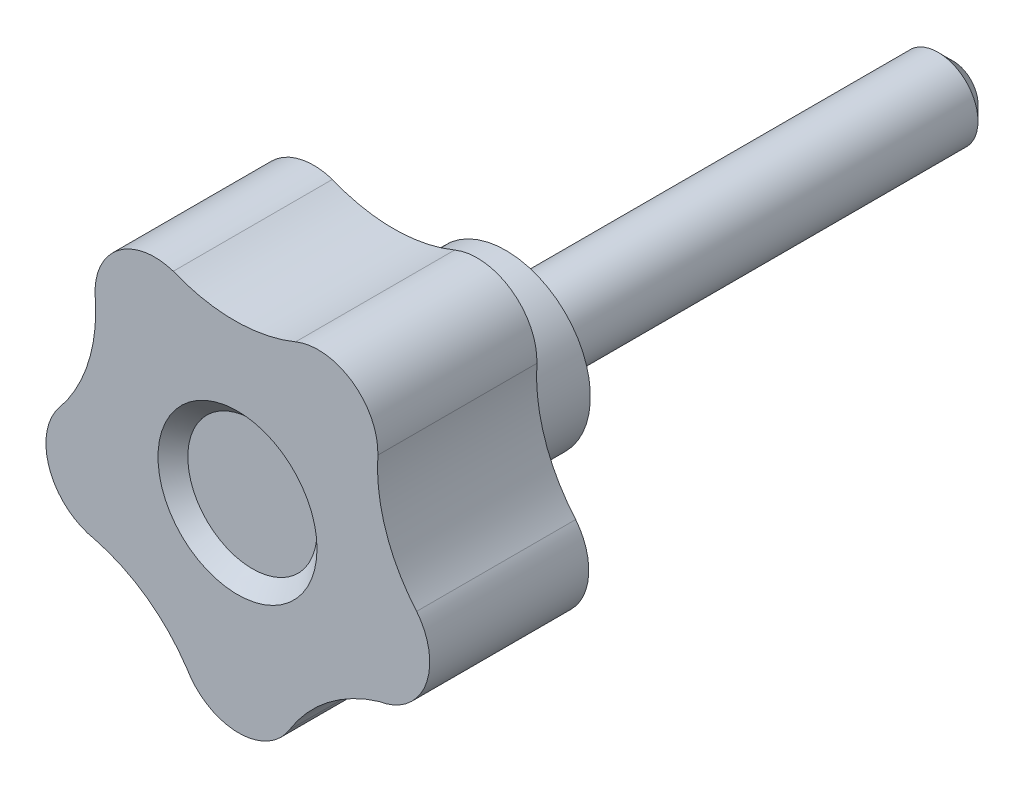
ISO-10303-21;
HEADER;
FILE_DESCRIPTION(('STEP AP214'),'2;1');
FILE_NAME('part.step','',(''),(''),'','','');
FILE_SCHEMA(('AUTOMOTIVE_DESIGN { 1 0 10303 214 1 1 1 1 }'));
ENDSEC;
DATA;
#1=APPLICATION_CONTEXT('core data for automotive mechanical design processes');
#2=APPLICATION_PROTOCOL_DEFINITION('international standard','automotive_design',2000,#1);
#3=PRODUCT_CONTEXT('',#1,'mechanical');
#4=PRODUCT('Part','Part','',(#3));
#5=PRODUCT_RELATED_PRODUCT_CATEGORY('part','',(#4));
#6=PRODUCT_DEFINITION_FORMATION('','',#4);
#7=PRODUCT_DEFINITION_CONTEXT('part definition',#1,'design');
#8=PRODUCT_DEFINITION('design','',#6,#7);
#9=PRODUCT_DEFINITION_SHAPE('','',#8);
#10=(LENGTH_UNIT() NAMED_UNIT(*) SI_UNIT(.MILLI.,.METRE.));
#11=(NAMED_UNIT(*) PLANE_ANGLE_UNIT() SI_UNIT($,.RADIAN.));
#12=(NAMED_UNIT(*) SI_UNIT($,.STERADIAN.) SOLID_ANGLE_UNIT());
#13=UNCERTAINTY_MEASURE_WITH_UNIT(LENGTH_MEASURE(1.E-05),#10,'distance_accuracy_value','');
#14=(GEOMETRIC_REPRESENTATION_CONTEXT(3) GLOBAL_UNCERTAINTY_ASSIGNED_CONTEXT((#13)) GLOBAL_UNIT_ASSIGNED_CONTEXT((#10,
#11,#12)) REPRESENTATION_CONTEXT('',''));
#15=CARTESIAN_POINT('',(0.,0.,0.));
#16=DIRECTION('',(0.,0.,1.));
#17=DIRECTION('',(1.,0.,0.));
#18=AXIS2_PLACEMENT_3D('',#15,#16,#17);
#19=CARTESIAN_POINT('',(0.,0.,-1.5));
#20=DIRECTION('',(0.,0.,-1.));
#21=DIRECTION('',(-1.,0.,0.));
#22=AXIS2_PLACEMENT_3D('',#19,#20,#21);
#23=PLANE('',#22);
#24=CARTESIAN_POINT('',(0.,0.,-1.50000000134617));
#25=DIRECTION('',(0.,0.,1.));
#26=DIRECTION('',(1.,0.,0.));
#27=AXIS2_PLACEMENT_3D('',#24,#25,#26);
#28=CIRCLE('',#27,6.50000000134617);
#29=CARTESIAN_POINT('',(6.50000000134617,0.,-1.50000000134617));
#30=VERTEX_POINT('',#29);
#31=EDGE_CURVE('E18',#30,#30,#28,.T.);
#32=ORIENTED_EDGE('',*,*,#31,.T.);
#33=EDGE_LOOP('',(#32));
#34=FACE_BOUND('',#33,.T.);
#35=ADVANCED_FACE('F15',(#34),#23,.F.);
#36=CARTESIAN_POINT('',(0.,0.,0.));
#37=DIRECTION('',(0.,0.,1.));
#38=DIRECTION('',(1.,0.,0.));
#39=AXIS2_PLACEMENT_3D('',#36,#37,#38);
#40=CONICAL_SURFACE('',#39,8.,0.7853981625);
#41=CARTESIAN_POINT('',(0.,0.,0.));
#42=DIRECTION('',(0.,0.,1.));
#43=DIRECTION('',(1.,0.,0.));
#44=AXIS2_PLACEMENT_3D('',#41,#42,#43);
#45=CIRCLE('',#44,8.);
#46=CARTESIAN_POINT('',(8.,0.,0.));
#47=VERTEX_POINT('',#46);
#48=EDGE_CURVE('E163',#47,#47,#45,.F.);
#49=ORIENTED_EDGE('',*,*,#48,.F.);
#50=EDGE_LOOP('',(#49));
#51=FACE_BOUND('',#50,.T.);
#52=ORIENTED_EDGE('',*,*,#31,.F.);
#53=EDGE_LOOP('',(#52));
#54=FACE_BOUND('',#53,.T.);
#55=ADVANCED_FACE('F328',(#51,#54),#40,.F.);
#56=CARTESIAN_POINT('',(-0.0004142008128,0.004852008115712,0.));
#57=DIRECTION('',(0.,0.,1.));
#58=DIRECTION('',(1.,0.,0.));
#59=AXIS2_PLACEMENT_3D('',#56,#57,#58);
#60=PLANE('',#59);
#61=ORIENTED_EDGE('',*,*,#48,.T.);
#62=EDGE_LOOP('',(#61));
#63=FACE_BOUND('',#62,.T.);
#64=CARTESIAN_POINT('',(-18.4150209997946,-25.8349379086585,0.));
#65=DIRECTION('',(0.,0.,-1.));
#66=DIRECTION('',(-1.,0.,0.));
#67=AXIS2_PLACEMENT_3D('',#64,#65,#66);
#68=CIRCLE('',#67,15.9939018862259);
#69=CARTESIAN_POINT('',(-14.3741936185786,-10.3599060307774,0.));
#70=VERTEX_POINT('',#69);
#71=CARTESIAN_POINT('',(-5.10235955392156,-16.9705178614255,0.));
#72=VERTEX_POINT('',#71);
#73=EDGE_CURVE('E196',#70,#72,#68,.T.);
#74=ORIENTED_EDGE('',*,*,#73,.T.);
#75=CARTESIAN_POINT('',(0.118807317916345,-13.9816803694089,0.));
#76=DIRECTION('',(0.,0.,-1.));
#77=DIRECTION('',(-1.,0.,0.));
#78=AXIS2_PLACEMENT_3D('',#75,#76,#77);
#79=CIRCLE('',#78,6.01612275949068);
#80=CARTESIAN_POINT('',(5.23314372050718,-17.1498495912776,0.));
#81=VERTEX_POINT('',#80);
#82=EDGE_CURVE('E191',#81,#72,#79,.T.);
#83=ORIENTED_EDGE('',*,*,#82,.F.);
#84=CARTESIAN_POINT('',(18.9162231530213,-25.544321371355,0.));
#85=DIRECTION('',(0.,0.,-1.));
#86=DIRECTION('',(-1.,0.,0.));
#87=AXIS2_PLACEMENT_3D('',#84,#85,#86);
#88=CIRCLE('',#87,16.0528445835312);
#89=CARTESIAN_POINT('',(14.2493413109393,-10.1848281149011,0.));
#90=VERTEX_POINT('',#89);
#91=EDGE_CURVE('E169',#81,#90,#88,.T.);
#92=ORIENTED_EDGE('',*,*,#91,.T.);
#93=CARTESIAN_POINT('',(13.2909378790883,-4.21108629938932,0.));
#94=DIRECTION('',(0.,0.,-1.));
#95=DIRECTION('',(-1.,0.,0.));
#96=AXIS2_PLACEMENT_3D('',#93,#94,#95);
#97=CIRCLE('',#96,6.05013457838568);
#98=CARTESIAN_POINT('',(18.023858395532,-0.442321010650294,0.));
#99=VERTEX_POINT('',#98);
#100=EDGE_CURVE('E166',#99,#90,#97,.T.);
#101=ORIENTED_EDGE('',*,*,#100,.F.);
#102=CARTESIAN_POINT('',(30.2805350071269,10.1431988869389,0.));
#103=DIRECTION('',(0.,0.,-1.));
#104=DIRECTION('',(-1.,0.,0.));
#105=AXIS2_PLACEMENT_3D('',#102,#103,#104);
#106=CIRCLE('',#105,16.1950410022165);
#107=CARTESIAN_POINT('',(14.1211155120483,11.216751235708,0.));
#108=VERTEX_POINT('',#107);
#109=EDGE_CURVE('E152',#99,#108,#106,.T.);
#110=ORIENTED_EDGE('',*,*,#109,.T.);
#111=CARTESIAN_POINT('',(8.12377943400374,11.3992354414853,0.));
#112=DIRECTION('',(0.,0.,-1.));
#113=DIRECTION('',(-1.,0.,0.));
#114=AXIS2_PLACEMENT_3D('',#111,#112,#113);
#115=CIRCLE('',#114,6.00011170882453);
#116=CARTESIAN_POINT('',(5.8467261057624,16.9504847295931,0.));
#117=VERTEX_POINT('',#116);
#118=EDGE_CURVE('E162',#117,#108,#115,.T.);
#119=ORIENTED_EDGE('',*,*,#118,.F.);
#120=CARTESIAN_POINT('',(-0.304345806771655,31.8234206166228,0.));
#121=DIRECTION('',(0.,0.,-1.));
#122=DIRECTION('',(-1.,0.,0.));
#123=AXIS2_PLACEMENT_3D('',#120,#121,#122);
#124=CIRCLE('',#123,16.0947167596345);
#125=CARTESIAN_POINT('',(-6.45541771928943,16.9504847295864,0.));
#126=VERTEX_POINT('',#125);
#127=EDGE_CURVE('E213',#117,#126,#124,.T.);
#128=ORIENTED_EDGE('',*,*,#127,.T.);
#129=CARTESIAN_POINT('',(-8.3283267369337,11.2475346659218,0.));
#130=DIRECTION('',(0.,0.,-1.));
#131=DIRECTION('',(-1.,0.,0.));
#132=AXIS2_PLACEMENT_3D('',#129,#130,#131);
#133=CIRCLE('',#132,6.00261839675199);
#134=CARTESIAN_POINT('',(-14.3141303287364,10.7985547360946,0.));
#135=VERTEX_POINT('',#134);
#136=EDGE_CURVE('E208',#135,#126,#133,.T.);
#137=ORIENTED_EDGE('',*,*,#136,.F.);
#138=CARTESIAN_POINT('',(-30.3288462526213,9.55164569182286,0.));
#139=DIRECTION('',(0.,0.,-1.));
#140=DIRECTION('',(-1.,0.,0.));
#141=AXIS2_PLACEMENT_3D('',#138,#139,#140);
#142=CIRCLE('',#141,16.0631848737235);
#143=CARTESIAN_POINT('',(-17.9188230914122,-0.647238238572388,0.));
#144=VERTEX_POINT('',#143);
#145=EDGE_CURVE('E204',#135,#144,#142,.T.);
#146=ORIENTED_EDGE('',*,*,#145,.T.);
#147=CARTESIAN_POINT('',(-13.258877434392,-4.44973379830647,0.));
#148=DIRECTION('',(0.,0.,-1.));
#149=DIRECTION('',(-1.,0.,0.));
#150=AXIS2_PLACEMENT_3D('',#147,#148,#149);
#151=CIRCLE('',#150,6.01448800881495);
#152=EDGE_CURVE('E200',#70,#144,#151,.T.);
#153=ORIENTED_EDGE('',*,*,#152,.F.);
#154=EDGE_LOOP('',(#74,#83,#92,#101,#110,#119,#128,#137,#146,#153));
#155=FACE_BOUND('',#154,.T.);
#156=ADVANCED_FACE('F167',(#63,#155),#60,.T.);
#157=CARTESIAN_POINT('',(30.2805350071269,10.1431988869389,0.));
#158=DIRECTION('',(0.,0.,-1.));
#159=DIRECTION('',(-1.,0.,0.));
#160=AXIS2_PLACEMENT_3D('',#157,#158,#159);
#161=CYLINDRICAL_SURFACE('',#160,16.1950410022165);
#162=DIRECTION('',(0.,0.,-1.));
#163=VECTOR('',#162,1.);
#164=CARTESIAN_POINT('',(14.1211155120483,11.2167512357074,0.));
#165=LINE('',#164,#163);
#166=CARTESIAN_POINT('',(14.1211155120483,11.216751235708,-16.));
#167=VERTEX_POINT('',#166);
#168=EDGE_CURVE('E159',#108,#167,#165,.T.);
#169=ORIENTED_EDGE('',*,*,#168,.F.);
#170=ORIENTED_EDGE('',*,*,#109,.F.);
#171=DIRECTION('',(0.,0.,-1.));
#172=VECTOR('',#171,1.);
#173=CARTESIAN_POINT('',(18.0238583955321,-0.442321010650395,0.));
#174=LINE('',#173,#172);
#175=CARTESIAN_POINT('',(18.0238583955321,-0.442321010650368,-16.));
#176=VERTEX_POINT('',#175);
#177=EDGE_CURVE('E156',#176,#99,#174,.F.);
#178=ORIENTED_EDGE('',*,*,#177,.F.);
#179=CARTESIAN_POINT('',(30.2805350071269,10.1431988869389,-16.));
#180=DIRECTION('',(0.,0.,-1.));
#181=DIRECTION('',(-1.,0.,0.));
#182=AXIS2_PLACEMENT_3D('',#179,#180,#181);
#183=CIRCLE('',#182,16.1950410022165);
#184=EDGE_CURVE('E310',#176,#167,#183,.T.);
#185=ORIENTED_EDGE('',*,*,#184,.T.);
#186=EDGE_LOOP('',(#169,#170,#178,#185));
#187=FACE_BOUND('',#186,.T.);
#188=ADVANCED_FACE('F154',(#187),#161,.F.);
#189=CARTESIAN_POINT('',(8.12377943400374,11.3992354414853,0.));
#190=DIRECTION('',(0.,0.,-1.));
#191=DIRECTION('',(-1.,0.,0.));
#192=AXIS2_PLACEMENT_3D('',#189,#190,#191);
#193=CYLINDRICAL_SURFACE('',#192,6.00011170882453);
#194=ORIENTED_EDGE('',*,*,#118,.T.);
#195=ORIENTED_EDGE('',*,*,#168,.T.);
#196=CARTESIAN_POINT('',(8.12377943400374,11.3992354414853,-16.));
#197=DIRECTION('',(0.,0.,-1.));
#198=DIRECTION('',(-1.,0.,0.));
#199=AXIS2_PLACEMENT_3D('',#196,#197,#198);
#200=CIRCLE('',#199,6.00011170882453);
#201=CARTESIAN_POINT('',(5.8467261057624,16.9504847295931,-16.));
#202=VERTEX_POINT('',#201);
#203=EDGE_CURVE('E308',#167,#202,#200,.F.);
#204=ORIENTED_EDGE('',*,*,#203,.T.);
#205=DIRECTION('',(0.,0.,-1.));
#206=VECTOR('',#205,1.);
#207=CARTESIAN_POINT('',(5.84672610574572,16.9504847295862,0.));
#208=LINE('',#207,#206);
#209=EDGE_CURVE('E209',#202,#117,#208,.F.);
#210=ORIENTED_EDGE('',*,*,#209,.T.);
#211=EDGE_LOOP('',(#194,#195,#204,#210));
#212=FACE_BOUND('',#211,.T.);
#213=ADVANCED_FACE('F447',(#212),#193,.T.);
#214=CARTESIAN_POINT('',(-0.304345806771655,31.8234206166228,0.));
#215=DIRECTION('',(0.,0.,-1.));
#216=DIRECTION('',(-1.,0.,0.));
#217=AXIS2_PLACEMENT_3D('',#214,#215,#216);
#218=CYLINDRICAL_SURFACE('',#217,16.0947167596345);
#219=DIRECTION('',(0.,0.,-1.));
#220=VECTOR('',#219,1.);
#221=CARTESIAN_POINT('',(-6.45541771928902,16.9504847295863,0.));
#222=LINE('',#221,#220);
#223=CARTESIAN_POINT('',(-6.45541771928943,16.9504847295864,-16.));
#224=VERTEX_POINT('',#223);
#225=EDGE_CURVE('E205',#126,#224,#222,.T.);
#226=ORIENTED_EDGE('',*,*,#225,.F.);
#227=ORIENTED_EDGE('',*,*,#127,.F.);
#228=ORIENTED_EDGE('',*,*,#209,.F.);
#229=CARTESIAN_POINT('',(-0.304345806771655,31.8234206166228,-16.));
#230=DIRECTION('',(0.,0.,-1.));
#231=DIRECTION('',(-1.,0.,0.));
#232=AXIS2_PLACEMENT_3D('',#229,#230,#231);
#233=CIRCLE('',#232,16.0947167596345);
#234=EDGE_CURVE('E306',#202,#224,#233,.T.);
#235=ORIENTED_EDGE('',*,*,#234,.T.);
#236=EDGE_LOOP('',(#226,#227,#228,#235));
#237=FACE_BOUND('',#236,.T.);
#238=ADVANCED_FACE('F443',(#237),#218,.F.);
#239=CARTESIAN_POINT('',(-8.3283267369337,11.2475346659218,0.));
#240=DIRECTION('',(0.,0.,-1.));
#241=DIRECTION('',(-1.,0.,0.));
#242=AXIS2_PLACEMENT_3D('',#239,#240,#241);
#243=CYLINDRICAL_SURFACE('',#242,6.00261839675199);
#244=ORIENTED_EDGE('',*,*,#136,.T.);
#245=ORIENTED_EDGE('',*,*,#225,.T.);
#246=CARTESIAN_POINT('',(-8.3283267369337,11.2475346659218,-16.));
#247=DIRECTION('',(0.,0.,-1.));
#248=DIRECTION('',(-1.,0.,0.));
#249=AXIS2_PLACEMENT_3D('',#246,#247,#248);
#250=CIRCLE('',#249,6.00261839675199);
#251=CARTESIAN_POINT('',(-14.3141303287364,10.7985547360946,-16.));
#252=VERTEX_POINT('',#251);
#253=EDGE_CURVE('E304',#224,#252,#250,.F.);
#254=ORIENTED_EDGE('',*,*,#253,.T.);
#255=DIRECTION('',(0.,0.,-1.));
#256=VECTOR('',#255,1.);
#257=CARTESIAN_POINT('',(-14.3141303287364,10.7985547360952,0.));
#258=LINE('',#257,#256);
#259=EDGE_CURVE('E201',#252,#135,#258,.F.);
#260=ORIENTED_EDGE('',*,*,#259,.T.);
#261=EDGE_LOOP('',(#244,#245,#254,#260));
#262=FACE_BOUND('',#261,.T.);
#263=ADVANCED_FACE('F439',(#262),#243,.T.);
#264=CARTESIAN_POINT('',(-30.3288462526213,9.55164569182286,0.));
#265=DIRECTION('',(0.,0.,-1.));
#266=DIRECTION('',(-1.,0.,0.));
#267=AXIS2_PLACEMENT_3D('',#264,#265,#266);
#268=CYLINDRICAL_SURFACE('',#267,16.0631848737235);
#269=DIRECTION('',(0.,0.,-1.));
#270=VECTOR('',#269,1.);
#271=CARTESIAN_POINT('',(-17.9188230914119,-0.647238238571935,0.));
#272=LINE('',#271,#270);
#273=CARTESIAN_POINT('',(-17.9188230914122,-0.647238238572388,-16.));
#274=VERTEX_POINT('',#273);
#275=EDGE_CURVE('E197',#144,#274,#272,.T.);
#276=ORIENTED_EDGE('',*,*,#275,.F.);
#277=ORIENTED_EDGE('',*,*,#145,.F.);
#278=ORIENTED_EDGE('',*,*,#259,.F.);
#279=CARTESIAN_POINT('',(-30.3288462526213,9.55164569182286,-16.));
#280=DIRECTION('',(0.,0.,-1.));
#281=DIRECTION('',(-1.,0.,0.));
#282=AXIS2_PLACEMENT_3D('',#279,#280,#281);
#283=CIRCLE('',#282,16.0631848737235);
#284=EDGE_CURVE('E302',#252,#274,#283,.T.);
#285=ORIENTED_EDGE('',*,*,#284,.T.);
#286=EDGE_LOOP('',(#276,#277,#278,#285));
#287=FACE_BOUND('',#286,.T.);
#288=ADVANCED_FACE('F435',(#287),#268,.F.);
#289=CARTESIAN_POINT('',(-13.258877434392,-4.44973379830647,0.));
#290=DIRECTION('',(0.,0.,-1.));
#291=DIRECTION('',(-1.,0.,0.));
#292=AXIS2_PLACEMENT_3D('',#289,#290,#291);
#293=CYLINDRICAL_SURFACE('',#292,6.01448800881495);
#294=ORIENTED_EDGE('',*,*,#152,.T.);
#295=ORIENTED_EDGE('',*,*,#275,.T.);
#296=CARTESIAN_POINT('',(-13.258877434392,-4.44973379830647,-16.));
#297=DIRECTION('',(0.,0.,-1.));
#298=DIRECTION('',(-1.,0.,0.));
#299=AXIS2_PLACEMENT_3D('',#296,#297,#298);
#300=CIRCLE('',#299,6.01448800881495);
#301=CARTESIAN_POINT('',(-14.3741936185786,-10.3599060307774,-16.));
#302=VERTEX_POINT('',#301);
#303=EDGE_CURVE('E300',#274,#302,#300,.F.);
#304=ORIENTED_EDGE('',*,*,#303,.T.);
#305=DIRECTION('',(0.,0.,-1.));
#306=VECTOR('',#305,1.);
#307=CARTESIAN_POINT('',(-14.3741936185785,-10.3599060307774,0.));
#308=LINE('',#307,#306);
#309=EDGE_CURVE('E192',#302,#70,#308,.F.);
#310=ORIENTED_EDGE('',*,*,#309,.T.);
#311=EDGE_LOOP('',(#294,#295,#304,#310));
#312=FACE_BOUND('',#311,.T.);
#313=ADVANCED_FACE('F431',(#312),#293,.T.);
#314=CARTESIAN_POINT('',(-18.4150209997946,-25.8349379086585,0.));
#315=DIRECTION('',(0.,0.,-1.));
#316=DIRECTION('',(-1.,0.,0.));
#317=AXIS2_PLACEMENT_3D('',#314,#315,#316);
#318=CYLINDRICAL_SURFACE('',#317,15.9939018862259);
#319=DIRECTION('',(0.,0.,-1.));
#320=VECTOR('',#319,1.);
#321=CARTESIAN_POINT('',(-5.10235955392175,-16.9705178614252,0.));
#322=LINE('',#321,#320);
#323=CARTESIAN_POINT('',(-5.10235955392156,-16.9705178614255,-16.));
#324=VERTEX_POINT('',#323);
#325=EDGE_CURVE('E187',#72,#324,#322,.T.);
#326=ORIENTED_EDGE('',*,*,#325,.F.);
#327=ORIENTED_EDGE('',*,*,#73,.F.);
#328=ORIENTED_EDGE('',*,*,#309,.F.);
#329=CARTESIAN_POINT('',(-18.4150209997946,-25.8349379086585,-16.));
#330=DIRECTION('',(0.,0.,-1.));
#331=DIRECTION('',(-1.,0.,0.));
#332=AXIS2_PLACEMENT_3D('',#329,#330,#331);
#333=CIRCLE('',#332,15.9939018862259);
#334=EDGE_CURVE('E298',#302,#324,#333,.T.);
#335=ORIENTED_EDGE('',*,*,#334,.T.);
#336=EDGE_LOOP('',(#326,#327,#328,#335));
#337=FACE_BOUND('',#336,.T.);
#338=ADVANCED_FACE('F427',(#337),#318,.F.);
#339=CARTESIAN_POINT('',(0.118807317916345,-13.9816803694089,0.));
#340=DIRECTION('',(0.,0.,-1.));
#341=DIRECTION('',(-1.,0.,0.));
#342=AXIS2_PLACEMENT_3D('',#339,#340,#341);
#343=CYLINDRICAL_SURFACE('',#342,6.01612275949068);
#344=ORIENTED_EDGE('',*,*,#82,.T.);
#345=ORIENTED_EDGE('',*,*,#325,.T.);
#346=CARTESIAN_POINT('',(0.118807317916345,-13.9816803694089,-16.));
#347=DIRECTION('',(0.,0.,-1.));
#348=DIRECTION('',(-1.,0.,0.));
#349=AXIS2_PLACEMENT_3D('',#346,#347,#348);
#350=CIRCLE('',#349,6.01612275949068);
#351=CARTESIAN_POINT('',(5.23314372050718,-17.1498495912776,-16.));
#352=VERTEX_POINT('',#351);
#353=EDGE_CURVE('E296',#324,#352,#350,.F.);
#354=ORIENTED_EDGE('',*,*,#353,.T.);
#355=DIRECTION('',(0.,0.,-1.));
#356=VECTOR('',#355,1.);
#357=CARTESIAN_POINT('',(5.23314372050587,-17.1498495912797,0.));
#358=LINE('',#357,#356);
#359=EDGE_CURVE('E180',#352,#81,#358,.F.);
#360=ORIENTED_EDGE('',*,*,#359,.T.);
#361=EDGE_LOOP('',(#344,#345,#354,#360));
#362=FACE_BOUND('',#361,.T.);
#363=ADVANCED_FACE('F423',(#362),#343,.T.);
#364=CARTESIAN_POINT('',(18.9162231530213,-25.544321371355,0.));
#365=DIRECTION('',(0.,0.,-1.));
#366=DIRECTION('',(-1.,0.,0.));
#367=AXIS2_PLACEMENT_3D('',#364,#365,#366);
#368=CYLINDRICAL_SURFACE('',#367,16.0528445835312);
#369=DIRECTION('',(0.,0.,-1.));
#370=VECTOR('',#369,1.);
#371=CARTESIAN_POINT('',(14.2493413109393,-10.1848281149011,0.));
#372=LINE('',#371,#370);
#373=CARTESIAN_POINT('',(14.2493413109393,-10.1848281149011,-16.));
#374=VERTEX_POINT('',#373);
#375=EDGE_CURVE('E173',#90,#374,#372,.T.);
#376=ORIENTED_EDGE('',*,*,#375,.F.);
#377=ORIENTED_EDGE('',*,*,#91,.F.);
#378=ORIENTED_EDGE('',*,*,#359,.F.);
#379=CARTESIAN_POINT('',(18.9162231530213,-25.544321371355,-16.));
#380=DIRECTION('',(0.,0.,-1.));
#381=DIRECTION('',(-1.,0.,0.));
#382=AXIS2_PLACEMENT_3D('',#379,#380,#381);
#383=CIRCLE('',#382,16.0528445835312);
#384=EDGE_CURVE('E294',#352,#374,#383,.T.);
#385=ORIENTED_EDGE('',*,*,#384,.T.);
#386=EDGE_LOOP('',(#376,#377,#378,#385));
#387=FACE_BOUND('',#386,.T.);
#388=ADVANCED_FACE('F420',(#387),#368,.F.);
#389=CARTESIAN_POINT('',(13.2909378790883,-4.21108629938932,0.));
#390=DIRECTION('',(0.,0.,-1.));
#391=DIRECTION('',(-1.,0.,0.));
#392=AXIS2_PLACEMENT_3D('',#389,#390,#391);
#393=CYLINDRICAL_SURFACE('',#392,6.05013457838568);
#394=ORIENTED_EDGE('',*,*,#100,.T.);
#395=ORIENTED_EDGE('',*,*,#375,.T.);
#396=CARTESIAN_POINT('',(13.2909378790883,-4.21108629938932,-16.));
#397=DIRECTION('',(0.,0.,-1.));
#398=DIRECTION('',(-1.,0.,0.));
#399=AXIS2_PLACEMENT_3D('',#396,#397,#398);
#400=CIRCLE('',#399,6.05013457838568);
#401=EDGE_CURVE('E177',#374,#176,#400,.F.);
#402=ORIENTED_EDGE('',*,*,#401,.T.);
#403=ORIENTED_EDGE('',*,*,#177,.T.);
#404=EDGE_LOOP('',(#394,#395,#402,#403));
#405=FACE_BOUND('',#404,.T.);
#406=ADVANCED_FACE('F175',(#405),#393,.T.);
#407=CARTESIAN_POINT('',(-0.0004142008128,0.004852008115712,-16.));
#408=DIRECTION('',(0.,0.,1.));
#409=DIRECTION('',(1.,0.,0.));
#410=AXIS2_PLACEMENT_3D('',#407,#408,#409);
#411=PLANE('',#410);
#412=CARTESIAN_POINT('',(30.2805350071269,10.1431988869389,-16.));
#413=DIRECTION('',(0.,0.,-1.));
#414=DIRECTION('',(-1.,0.,0.));
#415=AXIS2_PLACEMENT_3D('',#412,#413,#414);
#416=CIRCLE('',#415,19.6950410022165);
#417=CARTESIAN_POINT('',(10.6237156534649,11.3696135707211,-16.));
#418=VERTEX_POINT('',#417);
#419=CARTESIAN_POINT('',(15.3176912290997,-2.66335982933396,-16.));
#420=VERTEX_POINT('',#419);
#421=EDGE_CURVE('E287',#418,#420,#416,.F.);
#422=ORIENTED_EDGE('',*,*,#421,.F.);
#423=CARTESIAN_POINT('',(8.12377943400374,11.3992354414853,-16.));
#424=DIRECTION('',(0.,0.,-1.));
#425=DIRECTION('',(-1.,0.,0.));
#426=AXIS2_PLACEMENT_3D('',#423,#424,#425);
#427=CIRCLE('',#426,2.50011170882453);
#428=CARTESIAN_POINT('',(7.17844479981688,13.71373344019,-16.));
#429=VERTEX_POINT('',#428);
#430=EDGE_CURVE('E284',#418,#429,#427,.F.);
#431=ORIENTED_EDGE('',*,*,#430,.T.);
#432=CARTESIAN_POINT('',(-0.304345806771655,31.8234206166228,-16.));
#433=DIRECTION('',(0.,0.,-1.));
#434=DIRECTION('',(-1.,0.,0.));
#435=AXIS2_PLACEMENT_3D('',#432,#433,#434);
#436=CIRCLE('',#435,19.5947167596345);
#437=CARTESIAN_POINT('',(-7.6399742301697,13.6536247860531,-16.));
#438=VERTEX_POINT('',#437);
#439=EDGE_CURVE('E280',#438,#429,#436,.F.);
#440=ORIENTED_EDGE('',*,*,#439,.F.);
#441=CARTESIAN_POINT('',(-8.3283267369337,11.2475346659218,-16.));
#442=DIRECTION('',(0.,0.,-1.));
#443=DIRECTION('',(-1.,0.,0.));
#444=AXIS2_PLACEMENT_3D('',#441,#442,#443);
#445=CIRCLE('',#444,2.50261839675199);
#446=CARTESIAN_POINT('',(-10.8242060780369,11.0639995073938,-16.));
#447=VERTEX_POINT('',#446);
#448=EDGE_CURVE('E277',#438,#447,#445,.F.);
#449=ORIENTED_EDGE('',*,*,#448,.T.);
#450=CARTESIAN_POINT('',(-30.3288462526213,9.55164569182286,-16.));
#451=DIRECTION('',(0.,0.,-1.));
#452=DIRECTION('',(-1.,0.,0.));
#453=AXIS2_PLACEMENT_3D('',#450,#451,#452);
#454=CIRCLE('',#453,19.5631848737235);
#455=CARTESIAN_POINT('',(-15.2099194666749,-2.86351662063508,-16.));
#456=VERTEX_POINT('',#455);
#457=EDGE_CURVE('E273',#456,#447,#454,.F.);
#458=ORIENTED_EDGE('',*,*,#457,.F.);
#459=CARTESIAN_POINT('',(-13.258877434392,-4.44973379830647,-16.));
#460=DIRECTION('',(0.,0.,-1.));
#461=DIRECTION('',(-1.,0.,0.));
#462=AXIS2_PLACEMENT_3D('',#459,#460,#461);
#463=CIRCLE('',#462,2.51448800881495);
#464=CARTESIAN_POINT('',(-13.6373059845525,-6.93558209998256,-16.));
#465=VERTEX_POINT('',#464);
#466=EDGE_CURVE('E270',#456,#465,#463,.F.);
#467=ORIENTED_EDGE('',*,*,#466,.T.);
#468=CARTESIAN_POINT('',(-18.4150209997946,-25.8349379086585,-16.));
#469=DIRECTION('',(0.,0.,-1.));
#470=DIRECTION('',(-1.,0.,0.));
#471=AXIS2_PLACEMENT_3D('',#468,#469,#470);
#472=CIRCLE('',#471,19.4939018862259);
#473=CARTESIAN_POINT('',(-2.10692086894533,-15.1551401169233,-16.));
#474=VERTEX_POINT('',#473);
#475=EDGE_CURVE('E266',#474,#465,#472,.F.);
#476=ORIENTED_EDGE('',*,*,#475,.F.);
#477=CARTESIAN_POINT('',(0.118807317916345,-13.9816803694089,-16.));
#478=DIRECTION('',(0.,0.,-1.));
#479=DIRECTION('',(-1.,0.,0.));
#480=AXIS2_PLACEMENT_3D('',#477,#478,#479);
#481=CIRCLE('',#480,2.51612275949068);
#482=CARTESIAN_POINT('',(2.25482210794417,-15.311460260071,-16.));
#483=VERTEX_POINT('',#482);
#484=EDGE_CURVE('E263',#474,#483,#481,.F.);
#485=ORIENTED_EDGE('',*,*,#484,.T.);
#486=CARTESIAN_POINT('',(18.9162231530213,-25.544321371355,-16.));
#487=DIRECTION('',(0.,0.,-1.));
#488=DIRECTION('',(-1.,0.,0.));
#489=AXIS2_PLACEMENT_3D('',#486,#487,#488);
#490=CIRCLE('',#489,19.5528445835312);
#491=CARTESIAN_POINT('',(13.5196909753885,-6.75094030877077,-16.));
#492=VERTEX_POINT('',#491);
#493=EDGE_CURVE('E259',#492,#483,#490,.F.);
#494=ORIENTED_EDGE('',*,*,#493,.F.);
#495=CARTESIAN_POINT('',(13.2909378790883,-4.21108629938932,-16.));
#496=DIRECTION('',(0.,0.,-1.));
#497=DIRECTION('',(-1.,0.,0.));
#498=AXIS2_PLACEMENT_3D('',#495,#496,#497);
#499=CIRCLE('',#498,2.55013457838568);
#500=EDGE_CURVE('E291',#492,#420,#499,.F.);
#501=ORIENTED_EDGE('',*,*,#500,.T.);
#502=EDGE_LOOP('',(#422,#431,#440,#449,#458,#467,#476,#485,#494,#501));
#503=FACE_BOUND('',#502,.T.);
#504=ORIENTED_EDGE('',*,*,#384,.F.);
#505=ORIENTED_EDGE('',*,*,#353,.F.);
#506=ORIENTED_EDGE('',*,*,#334,.F.);
#507=ORIENTED_EDGE('',*,*,#303,.F.);
#508=ORIENTED_EDGE('',*,*,#284,.F.);
#509=ORIENTED_EDGE('',*,*,#253,.F.);
#510=ORIENTED_EDGE('',*,*,#234,.F.);
#511=ORIENTED_EDGE('',*,*,#203,.F.);
#512=ORIENTED_EDGE('',*,*,#184,.F.);
#513=ORIENTED_EDGE('',*,*,#401,.F.);
#514=EDGE_LOOP('',(#504,#505,#506,#507,#508,#509,#510,#511,#512,#513));
#515=FACE_BOUND('',#514,.T.);
#516=ADVANCED_FACE('F413',(#503,#515),#411,.F.);
#517=CARTESIAN_POINT('',(13.2909378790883,-4.21108629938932,0.));
#518=DIRECTION('',(0.,0.,-1.));
#519=DIRECTION('',(-1.,0.,0.));
#520=AXIS2_PLACEMENT_3D('',#517,#518,#519);
#521=CYLINDRICAL_SURFACE('',#520,2.55013457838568);
#522=DIRECTION('',(0.,0.,-1.));
#523=VECTOR('',#522,1.);
#524=CARTESIAN_POINT('',(13.519690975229,-6.75094030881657,0.));
#525=LINE('',#524,#523);
#526=CARTESIAN_POINT('',(13.5196909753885,-6.75094030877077,-3.5));
#527=VERTEX_POINT('',#526);
#528=EDGE_CURVE('E258',#527,#492,#525,.T.);
#529=ORIENTED_EDGE('',*,*,#528,.F.);
#530=CARTESIAN_POINT('',(13.2909378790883,-4.21108629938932,-3.5));
#531=DIRECTION('',(0.,0.,-1.));
#532=DIRECTION('',(-1.,0.,0.));
#533=AXIS2_PLACEMENT_3D('',#530,#531,#532);
#534=CIRCLE('',#533,2.55013457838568);
#535=CARTESIAN_POINT('',(15.3176912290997,-2.66335982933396,-3.5));
#536=VERTEX_POINT('',#535);
#537=EDGE_CURVE('E256',#527,#536,#534,.F.);
#538=ORIENTED_EDGE('',*,*,#537,.T.);
#539=DIRECTION('',(0.,0.,-1.));
#540=VECTOR('',#539,1.);
#541=CARTESIAN_POINT('',(15.3176912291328,-2.66335982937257,0.));
#542=LINE('',#541,#540);
#543=EDGE_CURVE('E290',#420,#536,#542,.F.);
#544=ORIENTED_EDGE('',*,*,#543,.F.);
#545=ORIENTED_EDGE('',*,*,#500,.F.);
#546=EDGE_LOOP('',(#529,#538,#544,#545));
#547=FACE_BOUND('',#546,.T.);
#548=ADVANCED_FACE('F409',(#547),#521,.F.);
#549=CARTESIAN_POINT('',(30.2805350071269,10.1431988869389,0.));
#550=DIRECTION('',(0.,0.,-1.));
#551=DIRECTION('',(-1.,0.,0.));
#552=AXIS2_PLACEMENT_3D('',#549,#550,#551);
#553=CYLINDRICAL_SURFACE('',#552,19.6950410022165);
#554=CARTESIAN_POINT('',(30.2805350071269,10.1431988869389,-3.5));
#555=DIRECTION('',(0.,0.,-1.));
#556=DIRECTION('',(-1.,0.,0.));
#557=AXIS2_PLACEMENT_3D('',#554,#555,#556);
#558=CIRCLE('',#557,19.6950410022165);
#559=CARTESIAN_POINT('',(10.6237156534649,11.3696135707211,-3.5));
#560=VERTEX_POINT('',#559);
#561=EDGE_CURVE('E253',#536,#560,#558,.T.);
#562=ORIENTED_EDGE('',*,*,#561,.T.);
#563=DIRECTION('',(0.,0.,-1.));
#564=VECTOR('',#563,1.);
#565=CARTESIAN_POINT('',(10.6237156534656,11.3696135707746,0.));
#566=LINE('',#565,#564);
#567=EDGE_CURVE('E286',#560,#418,#566,.T.);
#568=ORIENTED_EDGE('',*,*,#567,.T.);
#569=ORIENTED_EDGE('',*,*,#421,.T.);
#570=ORIENTED_EDGE('',*,*,#543,.T.);
#571=EDGE_LOOP('',(#562,#568,#569,#570));
#572=FACE_BOUND('',#571,.T.);
#573=ADVANCED_FACE('F405',(#572),#553,.T.);
#574=CARTESIAN_POINT('',(8.12377943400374,11.3992354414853,0.));
#575=DIRECTION('',(0.,0.,-1.));
#576=DIRECTION('',(-1.,0.,0.));
#577=AXIS2_PLACEMENT_3D('',#574,#575,#576);
#578=CYLINDRICAL_SURFACE('',#577,2.50011170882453);
#579=ORIENTED_EDGE('',*,*,#567,.F.);
#580=CARTESIAN_POINT('',(8.12377943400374,11.3992354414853,-3.5));
#581=DIRECTION('',(0.,0.,-1.));
#582=DIRECTION('',(-1.,0.,0.));
#583=AXIS2_PLACEMENT_3D('',#580,#581,#582);
#584=CIRCLE('',#583,2.50011170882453);
#585=CARTESIAN_POINT('',(7.17844479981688,13.71373344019,-3.5));
#586=VERTEX_POINT('',#585);
#587=EDGE_CURVE('E250',#560,#586,#584,.F.);
#588=ORIENTED_EDGE('',*,*,#587,.T.);
#589=DIRECTION('',(0.,0.,-1.));
#590=VECTOR('',#589,1.);
#591=CARTESIAN_POINT('',(7.17844479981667,13.71373344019,0.));
#592=LINE('',#591,#590);
#593=EDGE_CURVE('E283',#429,#586,#592,.F.);
#594=ORIENTED_EDGE('',*,*,#593,.F.);
#595=ORIENTED_EDGE('',*,*,#430,.F.);
#596=EDGE_LOOP('',(#579,#588,#594,#595));
#597=FACE_BOUND('',#596,.T.);
#598=ADVANCED_FACE('F401',(#597),#578,.F.);
#599=CARTESIAN_POINT('',(-0.304345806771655,31.8234206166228,0.));
#600=DIRECTION('',(0.,0.,-1.));
#601=DIRECTION('',(-1.,0.,0.));
#602=AXIS2_PLACEMENT_3D('',#599,#600,#601);
#603=CYLINDRICAL_SURFACE('',#602,19.5947167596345);
#604=CARTESIAN_POINT('',(-0.304345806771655,31.8234206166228,-3.5));
#605=DIRECTION('',(0.,0.,-1.));
#606=DIRECTION('',(-1.,0.,0.));
#607=AXIS2_PLACEMENT_3D('',#604,#605,#606);
#608=CIRCLE('',#607,19.5947167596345);
#609=CARTESIAN_POINT('',(-7.6399742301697,13.6536247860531,-3.5));
#610=VERTEX_POINT('',#609);
#611=EDGE_CURVE('E247',#586,#610,#608,.T.);
#612=ORIENTED_EDGE('',*,*,#611,.T.);
#613=DIRECTION('',(0.,0.,-1.));
#614=VECTOR('',#613,1.);
#615=CARTESIAN_POINT('',(-7.63997423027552,13.6536247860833,0.));
#616=LINE('',#615,#614);
#617=EDGE_CURVE('E279',#610,#438,#616,.T.);
#618=ORIENTED_EDGE('',*,*,#617,.T.);
#619=ORIENTED_EDGE('',*,*,#439,.T.);
#620=ORIENTED_EDGE('',*,*,#593,.T.);
#621=EDGE_LOOP('',(#612,#618,#619,#620));
#622=FACE_BOUND('',#621,.T.);
#623=ADVANCED_FACE('F397',(#622),#603,.T.);
#624=CARTESIAN_POINT('',(-8.3283267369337,11.2475346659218,0.));
#625=DIRECTION('',(0.,0.,-1.));
#626=DIRECTION('',(-1.,0.,0.));
#627=AXIS2_PLACEMENT_3D('',#624,#625,#626);
#628=CYLINDRICAL_SURFACE('',#627,2.50261839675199);
#629=ORIENTED_EDGE('',*,*,#617,.F.);
#630=CARTESIAN_POINT('',(-8.3283267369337,11.2475346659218,-3.5));
#631=DIRECTION('',(0.,0.,-1.));
#632=DIRECTION('',(-1.,0.,0.));
#633=AXIS2_PLACEMENT_3D('',#630,#631,#632);
#634=CIRCLE('',#633,2.50261839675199);
#635=CARTESIAN_POINT('',(-10.8242060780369,11.0639995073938,-3.5));
#636=VERTEX_POINT('',#635);
#637=EDGE_CURVE('E245',#610,#636,#634,.F.);
#638=ORIENTED_EDGE('',*,*,#637,.T.);
#639=DIRECTION('',(0.,0.,-1.));
#640=VECTOR('',#639,1.);
#641=CARTESIAN_POINT('',(-10.8242060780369,11.0639995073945,0.));
#642=LINE('',#641,#640);
#643=EDGE_CURVE('E276',#447,#636,#642,.F.);
#644=ORIENTED_EDGE('',*,*,#643,.F.);
#645=ORIENTED_EDGE('',*,*,#448,.F.);
#646=EDGE_LOOP('',(#629,#638,#644,#645));
#647=FACE_BOUND('',#646,.T.);
#648=ADVANCED_FACE('F393',(#647),#628,.F.);
#649=CARTESIAN_POINT('',(-30.3288462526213,9.55164569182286,0.));
#650=DIRECTION('',(0.,0.,-1.));
#651=DIRECTION('',(-1.,0.,0.));
#652=AXIS2_PLACEMENT_3D('',#649,#650,#651);
#653=CYLINDRICAL_SURFACE('',#652,19.5631848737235);
#654=CARTESIAN_POINT('',(-30.3288462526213,9.55164569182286,-3.5));
#655=DIRECTION('',(0.,0.,-1.));
#656=DIRECTION('',(-1.,0.,0.));
#657=AXIS2_PLACEMENT_3D('',#654,#655,#656);
#658=CIRCLE('',#657,19.5631848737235);
#659=CARTESIAN_POINT('',(-15.2099194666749,-2.86351662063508,-3.5));
#660=VERTEX_POINT('',#659);
#661=EDGE_CURVE('E243',#636,#660,#658,.T.);
#662=ORIENTED_EDGE('',*,*,#661,.T.);
#663=DIRECTION('',(0.,0.,-1.));
#664=VECTOR('',#663,1.);
#665=CARTESIAN_POINT('',(-15.2099194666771,-2.86351662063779,0.));
#666=LINE('',#665,#664);
#667=EDGE_CURVE('E272',#660,#456,#666,.T.);
#668=ORIENTED_EDGE('',*,*,#667,.T.);
#669=ORIENTED_EDGE('',*,*,#457,.T.);
#670=ORIENTED_EDGE('',*,*,#643,.T.);
#671=EDGE_LOOP('',(#662,#668,#669,#670));
#672=FACE_BOUND('',#671,.T.);
#673=ADVANCED_FACE('F389',(#672),#653,.T.);
#674=CARTESIAN_POINT('',(-13.258877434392,-4.44973379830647,0.));
#675=DIRECTION('',(0.,0.,-1.));
#676=DIRECTION('',(-1.,0.,0.));
#677=AXIS2_PLACEMENT_3D('',#674,#675,#676);
#678=CYLINDRICAL_SURFACE('',#677,2.51448800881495);
#679=ORIENTED_EDGE('',*,*,#667,.F.);
#680=CARTESIAN_POINT('',(-13.258877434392,-4.44973379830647,-3.5));
#681=DIRECTION('',(0.,0.,-1.));
#682=DIRECTION('',(-1.,0.,0.));
#683=AXIS2_PLACEMENT_3D('',#680,#681,#682);
#684=CIRCLE('',#683,2.51448800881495);
#685=CARTESIAN_POINT('',(-13.6373059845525,-6.93558209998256,-3.5));
#686=VERTEX_POINT('',#685);
#687=EDGE_CURVE('E241',#660,#686,#684,.F.);
#688=ORIENTED_EDGE('',*,*,#687,.T.);
#689=DIRECTION('',(0.,0.,-1.));
#690=VECTOR('',#689,1.);
#691=CARTESIAN_POINT('',(-13.6373059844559,-6.93558210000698,0.));
#692=LINE('',#691,#690);
#693=EDGE_CURVE('E269',#465,#686,#692,.F.);
#694=ORIENTED_EDGE('',*,*,#693,.F.);
#695=ORIENTED_EDGE('',*,*,#466,.F.);
#696=EDGE_LOOP('',(#679,#688,#694,#695));
#697=FACE_BOUND('',#696,.T.);
#698=ADVANCED_FACE('F385',(#697),#678,.F.);
#699=CARTESIAN_POINT('',(-18.4150209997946,-25.8349379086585,0.));
#700=DIRECTION('',(0.,0.,-1.));
#701=DIRECTION('',(-1.,0.,0.));
#702=AXIS2_PLACEMENT_3D('',#699,#700,#701);
#703=CYLINDRICAL_SURFACE('',#702,19.4939018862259);
#704=CARTESIAN_POINT('',(-18.4150209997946,-25.8349379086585,-3.5));
#705=DIRECTION('',(0.,0.,-1.));
#706=DIRECTION('',(-1.,0.,0.));
#707=AXIS2_PLACEMENT_3D('',#704,#705,#706);
#708=CIRCLE('',#707,19.4939018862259);
#709=CARTESIAN_POINT('',(-2.10692086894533,-15.1551401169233,-3.5));
#710=VERTEX_POINT('',#709);
#711=EDGE_CURVE('E239',#686,#710,#708,.T.);
#712=ORIENTED_EDGE('',*,*,#711,.T.);
#713=DIRECTION('',(0.,0.,-1.));
#714=VECTOR('',#713,1.);
#715=CARTESIAN_POINT('',(-2.1069208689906,-15.1551401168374,0.));
#716=LINE('',#715,#714);
#717=EDGE_CURVE('E265',#710,#474,#716,.T.);
#718=ORIENTED_EDGE('',*,*,#717,.T.);
#719=ORIENTED_EDGE('',*,*,#475,.T.);
#720=ORIENTED_EDGE('',*,*,#693,.T.);
#721=EDGE_LOOP('',(#712,#718,#719,#720));
#722=FACE_BOUND('',#721,.T.);
#723=ADVANCED_FACE('F382',(#722),#703,.T.);
#724=CARTESIAN_POINT('',(0.118807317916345,-13.9816803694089,0.));
#725=DIRECTION('',(0.,0.,-1.));
#726=DIRECTION('',(-1.,0.,0.));
#727=AXIS2_PLACEMENT_3D('',#724,#725,#726);
#728=CYLINDRICAL_SURFACE('',#727,2.51612275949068);
#729=ORIENTED_EDGE('',*,*,#717,.F.);
#730=CARTESIAN_POINT('',(0.118807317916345,-13.9816803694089,-3.5));
#731=DIRECTION('',(0.,0.,-1.));
#732=DIRECTION('',(-1.,0.,0.));
#733=AXIS2_PLACEMENT_3D('',#730,#731,#732);
#734=CIRCLE('',#733,2.51612275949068);
#735=CARTESIAN_POINT('',(2.25482210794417,-15.311460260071,-3.5));
#736=VERTEX_POINT('',#735);
#737=EDGE_CURVE('E33',#710,#736,#734,.F.);
#738=ORIENTED_EDGE('',*,*,#737,.T.);
#739=DIRECTION('',(0.,0.,-1.));
#740=VECTOR('',#739,1.);
#741=CARTESIAN_POINT('',(2.2548221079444,-15.3114602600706,0.));
#742=LINE('',#741,#740);
#743=EDGE_CURVE('E262',#483,#736,#742,.F.);
#744=ORIENTED_EDGE('',*,*,#743,.F.);
#745=ORIENTED_EDGE('',*,*,#484,.F.);
#746=EDGE_LOOP('',(#729,#738,#744,#745));
#747=FACE_BOUND('',#746,.T.);
#748=ADVANCED_FACE('F378',(#747),#728,.F.);
#749=CARTESIAN_POINT('',(18.9162231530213,-25.544321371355,0.));
#750=DIRECTION('',(0.,0.,-1.));
#751=DIRECTION('',(-1.,0.,0.));
#752=AXIS2_PLACEMENT_3D('',#749,#750,#751);
#753=CYLINDRICAL_SURFACE('',#752,19.5528445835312);
#754=CARTESIAN_POINT('',(18.9162231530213,-25.544321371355,-3.5));
#755=DIRECTION('',(0.,0.,-1.));
#756=DIRECTION('',(-1.,0.,0.));
#757=AXIS2_PLACEMENT_3D('',#754,#755,#756);
#758=CIRCLE('',#757,19.5528445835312);
#759=EDGE_CURVE('E235',#736,#527,#758,.T.);
#760=ORIENTED_EDGE('',*,*,#759,.T.);
#761=ORIENTED_EDGE('',*,*,#528,.T.);
#762=ORIENTED_EDGE('',*,*,#493,.T.);
#763=ORIENTED_EDGE('',*,*,#743,.T.);
#764=EDGE_LOOP('',(#760,#761,#762,#763));
#765=FACE_BOUND('',#764,.T.);
#766=ADVANCED_FACE('F374',(#765),#753,.T.);
#767=CARTESIAN_POINT('',(-0.0004142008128,0.004852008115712,-3.5));
#768=DIRECTION('',(0.,0.,1.));
#769=DIRECTION('',(1.,0.,0.));
#770=AXIS2_PLACEMENT_3D('',#767,#768,#769);
#771=PLANE('',#770);
#772=CARTESIAN_POINT('',(0.,0.,-3.5));
#773=DIRECTION('',(0.,0.,1.));
#774=DIRECTION('',(0.,-1.,0.));
#775=AXIS2_PLACEMENT_3D('',#772,#773,#774);
#776=CIRCLE('',#775,9.44974746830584);
#777=CARTESIAN_POINT('',(0.,-9.44974746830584,-3.5));
#778=VERTEX_POINT('',#777);
#779=EDGE_CURVE('E231',#778,#778,#776,.F.);
#780=ORIENTED_EDGE('',*,*,#779,.F.);
#781=EDGE_LOOP('',(#780));
#782=FACE_BOUND('',#781,.T.);
#783=ORIENTED_EDGE('',*,*,#737,.F.);
#784=ORIENTED_EDGE('',*,*,#711,.F.);
#785=ORIENTED_EDGE('',*,*,#687,.F.);
#786=ORIENTED_EDGE('',*,*,#661,.F.);
#787=ORIENTED_EDGE('',*,*,#637,.F.);
#788=ORIENTED_EDGE('',*,*,#611,.F.);
#789=ORIENTED_EDGE('',*,*,#587,.F.);
#790=ORIENTED_EDGE('',*,*,#561,.F.);
#791=ORIENTED_EDGE('',*,*,#537,.F.);
#792=ORIENTED_EDGE('',*,*,#759,.F.);
#793=EDGE_LOOP('',(#783,#784,#785,#786,#787,#788,#789,#790,#791,#792));
#794=FACE_BOUND('',#793,.T.);
#795=ADVANCED_FACE('F370',(#782,#794),#771,.F.);
#796=CARTESIAN_POINT('',(0.,0.,-3.5));
#797=DIRECTION('',(0.,0.,1.));
#798=DIRECTION('',(0.,-1.,0.));
#799=AXIS2_PLACEMENT_3D('',#796,#797,#798);
#800=CONICAL_SURFACE('',#799,9.44974746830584,0.0698131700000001);
#801=ORIENTED_EDGE('',*,*,#779,.T.);
#802=EDGE_LOOP('',(#801));
#803=FACE_BOUND('',#802,.T.);
#804=CARTESIAN_POINT('',(0.,0.,-12.0000000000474));
#805=DIRECTION('',(0.,0.,1.));
#806=DIRECTION('',(0.,-1.,0.));
#807=AXIS2_PLACEMENT_3D('',#804,#805,#806);
#808=CIRCLE('',#807,8.85536956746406);
#809=CARTESIAN_POINT('',(0.,-8.85536956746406,-12.0000000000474));
#810=VERTEX_POINT('',#809);
#811=EDGE_CURVE('E227',#810,#810,#808,.T.);
#812=ORIENTED_EDGE('',*,*,#811,.T.);
#813=EDGE_LOOP('',(#812));
#814=FACE_BOUND('',#813,.T.);
#815=ADVANCED_FACE('F366',(#803,#814),#800,.T.);
#816=CARTESIAN_POINT('',(0.,0.,-12.));
#817=DIRECTION('',(0.,0.,1.));
#818=DIRECTION('',(1.,0.,0.));
#819=AXIS2_PLACEMENT_3D('',#816,#817,#818);
#820=PLANE('',#819);
#821=CARTESIAN_POINT('',(0.,0.,-12.));
#822=DIRECTION('',(0.,0.,-1.));
#823=DIRECTION('',(-1.,0.,0.));
#824=AXIS2_PLACEMENT_3D('',#821,#822,#823);
#825=CIRCLE('',#824,8.5);
#826=CARTESIAN_POINT('',(-8.5,0.,-12.));
#827=VERTEX_POINT('',#826);
#828=EDGE_CURVE('E223',#827,#827,#825,.T.);
#829=ORIENTED_EDGE('',*,*,#828,.F.);
#830=EDGE_LOOP('',(#829));
#831=FACE_BOUND('',#830,.T.);
#832=ORIENTED_EDGE('',*,*,#811,.F.);
#833=EDGE_LOOP('',(#832));
#834=FACE_BOUND('',#833,.T.);
#835=ADVANCED_FACE('F362',(#831,#834),#820,.F.);
#836=CARTESIAN_POINT('',(0.,0.,-12.));
#837=DIRECTION('',(0.,0.,-1.));
#838=DIRECTION('',(-1.,0.,0.));
#839=AXIS2_PLACEMENT_3D('',#836,#837,#838);
#840=CYLINDRICAL_SURFACE('',#839,8.5);
#841=ORIENTED_EDGE('',*,*,#828,.T.);
#842=EDGE_LOOP('',(#841));
#843=FACE_BOUND('',#842,.T.);
#844=CARTESIAN_POINT('',(0.,0.,-27.));
#845=DIRECTION('',(0.,0.,-1.));
#846=DIRECTION('',(-1.,0.,0.));
#847=AXIS2_PLACEMENT_3D('',#844,#845,#846);
#848=CIRCLE('',#847,8.5);
#849=CARTESIAN_POINT('',(-8.5,0.,-27.));
#850=VERTEX_POINT('',#849);
#851=EDGE_CURVE('E220',#850,#850,#848,.F.);
#852=ORIENTED_EDGE('',*,*,#851,.T.);
#853=EDGE_LOOP('',(#852));
#854=FACE_BOUND('',#853,.T.);
#855=ADVANCED_FACE('F358',(#843,#854),#840,.T.);
#856=CARTESIAN_POINT('',(0.,0.,-72.));
#857=DIRECTION('',(0.,0.,1.));
#858=DIRECTION('',(1.,0.,0.));
#859=AXIS2_PLACEMENT_3D('',#856,#857,#858);
#860=PLANE('',#859);
#861=CARTESIAN_POINT('',(0.,0.,-72.000000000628));
#862=DIRECTION('',(0.,0.,1.));
#863=DIRECTION('',(1.,0.,0.));
#864=AXIS2_PLACEMENT_3D('',#861,#862,#863);
#865=CIRCLE('',#864,2.50000000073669);
#866=CARTESIAN_POINT('',(2.50000000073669,0.,-72.000000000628));
#867=VERTEX_POINT('',#866);
#868=EDGE_CURVE('E217',#867,#867,#865,.T.);
#869=ORIENTED_EDGE('',*,*,#868,.F.);
#870=EDGE_LOOP('',(#869));
#871=FACE_BOUND('',#870,.T.);
#872=ADVANCED_FACE('F354',(#871),#860,.F.);
#873=CARTESIAN_POINT('',(0.,0.,-27.));
#874=DIRECTION('',(0.,0.,1.));
#875=DIRECTION('',(1.,0.,0.));
#876=AXIS2_PLACEMENT_3D('',#873,#874,#875);
#877=PLANE('',#876);
#878=CARTESIAN_POINT('',(0.,0.,-27.));
#879=DIRECTION('',(0.,0.,-1.));
#880=DIRECTION('',(-1.,0.,0.));
#881=AXIS2_PLACEMENT_3D('',#878,#879,#880);
#882=CIRCLE('',#881,4.);
#883=CARTESIAN_POINT('',(-4.,0.,-27.));
#884=VERTEX_POINT('',#883);
#885=EDGE_CURVE('E24',#884,#884,#882,.T.);
#886=ORIENTED_EDGE('',*,*,#885,.F.);
#887=EDGE_LOOP('',(#886));
#888=FACE_BOUND('',#887,.T.);
#889=ORIENTED_EDGE('',*,*,#851,.F.);
#890=EDGE_LOOP('',(#889));
#891=FACE_BOUND('',#890,.T.);
#892=ADVANCED_FACE('F347',(#888,#891),#877,.F.);
#893=CARTESIAN_POINT('',(0.,0.,-70.4999999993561));
#894=DIRECTION('',(0.,0.,1.));
#895=DIRECTION('',(1.,0.,0.));
#896=AXIS2_PLACEMENT_3D('',#893,#894,#895);
#897=CONICAL_SURFACE('',#896,3.99999999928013,0.785398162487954);
#898=CARTESIAN_POINT('',(0.,0.,-70.5));
#899=DIRECTION('',(0.,0.,-1.));
#900=DIRECTION('',(-1.,0.,0.));
#901=AXIS2_PLACEMENT_3D('',#898,#899,#900);
#902=CIRCLE('',#901,4.);
#903=CARTESIAN_POINT('',(-4.,0.,-70.5));
#904=VERTEX_POINT('',#903);
#905=EDGE_CURVE('E10',#904,#904,#902,.F.);
#906=ORIENTED_EDGE('',*,*,#905,.F.);
#907=EDGE_LOOP('',(#906));
#908=FACE_BOUND('',#907,.T.);
#909=ORIENTED_EDGE('',*,*,#868,.T.);
#910=EDGE_LOOP('',(#909));
#911=FACE_BOUND('',#910,.T.);
#912=ADVANCED_FACE('F340',(#908,#911),#897,.T.);
#913=CARTESIAN_POINT('',(0.,0.,-27.));
#914=DIRECTION('',(0.,0.,-1.));
#915=DIRECTION('',(-1.,0.,0.));
#916=AXIS2_PLACEMENT_3D('',#913,#914,#915);
#917=CYLINDRICAL_SURFACE('',#916,4.);
#918=ORIENTED_EDGE('',*,*,#905,.T.);
#919=EDGE_LOOP('',(#918));
#920=FACE_BOUND('',#919,.T.);
#921=ORIENTED_EDGE('',*,*,#885,.T.);
#922=EDGE_LOOP('',(#921));
#923=FACE_BOUND('',#922,.T.);
#924=ADVANCED_FACE('F338',(#920,#923),#917,.T.);
#925=CLOSED_SHELL('',(#35,#55,#156,#188,#213,#238,#263,#288,#313,#338,#363,#388,#406,#516,#548,
#573,#598,#623,#648,#673,#698,#723,#748,#766,#795,#815,#835,#855,#872,#892,#912,#924));
#926=MANIFOLD_SOLID_BREP('B1',#925);
#927=ADVANCED_BREP_SHAPE_REPRESENTATION('',(#18,#926),#14);
#928=SHAPE_DEFINITION_REPRESENTATION(#9,#927);
ENDSEC;
END-ISO-10303-21;
